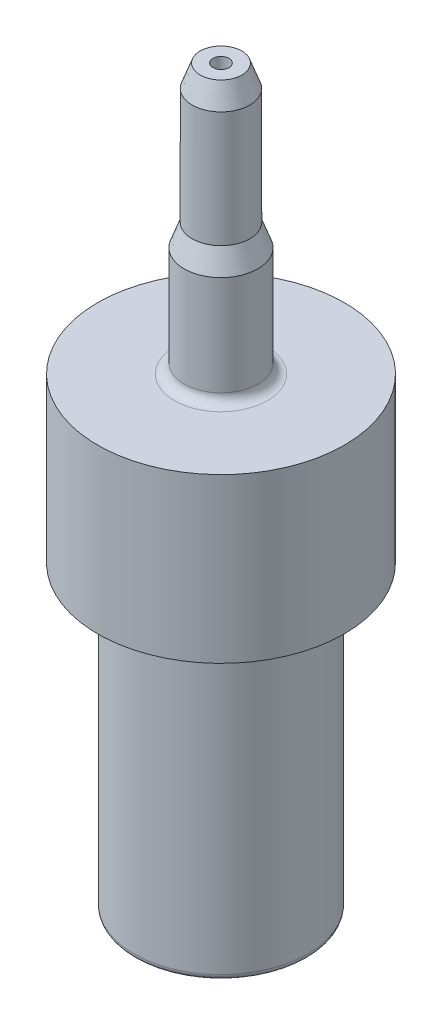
ISO-10303-21;
HEADER;
FILE_DESCRIPTION(('STEP AP214'),'2;1');
FILE_NAME('part.step','',(''),(''),'','','');
FILE_SCHEMA(('AUTOMOTIVE_DESIGN { 1 0 10303 214 1 1 1 1 }'));
ENDSEC;
DATA;
#1=APPLICATION_CONTEXT('core data for automotive mechanical design processes');
#2=APPLICATION_PROTOCOL_DEFINITION('international standard','automotive_design',2000,#1);
#3=PRODUCT_CONTEXT('',#1,'mechanical');
#4=PRODUCT('Part','Part','',(#3));
#5=PRODUCT_RELATED_PRODUCT_CATEGORY('part','',(#4));
#6=PRODUCT_DEFINITION_FORMATION('','',#4);
#7=PRODUCT_DEFINITION_CONTEXT('part definition',#1,'design');
#8=PRODUCT_DEFINITION('design','',#6,#7);
#9=PRODUCT_DEFINITION_SHAPE('','',#8);
#10=(LENGTH_UNIT() NAMED_UNIT(*) SI_UNIT(.MILLI.,.METRE.));
#11=(NAMED_UNIT(*) PLANE_ANGLE_UNIT() SI_UNIT($,.RADIAN.));
#12=(NAMED_UNIT(*) SI_UNIT($,.STERADIAN.) SOLID_ANGLE_UNIT());
#13=UNCERTAINTY_MEASURE_WITH_UNIT(LENGTH_MEASURE(1.E-05),#10,'distance_accuracy_value','');
#14=(GEOMETRIC_REPRESENTATION_CONTEXT(3) GLOBAL_UNCERTAINTY_ASSIGNED_CONTEXT((#13)) GLOBAL_UNIT_ASSIGNED_CONTEXT((#10,
#11,#12)) REPRESENTATION_CONTEXT('',''));
#15=CARTESIAN_POINT('',(0.,0.,0.));
#16=DIRECTION('',(0.,0.,1.));
#17=DIRECTION('',(1.,0.,0.));
#18=AXIS2_PLACEMENT_3D('',#15,#16,#17);
#19=CARTESIAN_POINT('',(2.58474408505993E-12,-740.300128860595,0.));
#20=DIRECTION('',(0.,-1.,0.));
#21=DIRECTION('',(1.,0.,0.));
#22=AXIS2_PLACEMENT_3D('',#19,#20,#21);
#23=CYLINDRICAL_SURFACE('',#22,2.70510000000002);
#24=CARTESIAN_POINT('',(0.,0.179999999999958,0.));
#25=DIRECTION('',(0.,-1.,0.));
#26=DIRECTION('',(1.,0.,0.));
#27=AXIS2_PLACEMENT_3D('',#24,#25,#26);
#28=CIRCLE('',#27,2.70510000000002);
#29=CARTESIAN_POINT('',(2.70510000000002,0.179999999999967,0.));
#30=VERTEX_POINT('',#29);
#31=EDGE_CURVE('E10',#30,#30,#28,.F.);
#32=ORIENTED_EDGE('',*,*,#31,.T.);
#33=EDGE_LOOP('',(#32));
#34=FACE_BOUND('',#33,.T.);
#35=CARTESIAN_POINT('',(0.,9.1,0.));
#36=DIRECTION('',(0.,-1.,0.));
#37=DIRECTION('',(1.,0.,0.));
#38=AXIS2_PLACEMENT_3D('',#35,#36,#37);
#39=CIRCLE('',#38,2.70510000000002);
#40=CARTESIAN_POINT('',(2.70509999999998,9.1,0.));
#41=VERTEX_POINT('',#40);
#42=EDGE_CURVE('E57',#41,#41,#39,.T.);
#43=ORIENTED_EDGE('',*,*,#42,.T.);
#44=EDGE_LOOP('',(#43));
#45=FACE_BOUND('',#44,.T.);
#46=ADVANCED_FACE('F34',(#34,#45),#23,.T.);
#47=CARTESIAN_POINT('',(0.250000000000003,0.,0.));
#48=DIRECTION('',(0.,-1.,0.));
#49=DIRECTION('',(1.,0.,0.));
#50=AXIS2_PLACEMENT_3D('',#47,#48,#49);
#51=PLANE('',#50);
#52=CARTESIAN_POINT('',(0.,0.,0.));
#53=DIRECTION('',(0.,-1.,0.));
#54=DIRECTION('',(1.,0.,0.));
#55=AXIS2_PLACEMENT_3D('',#52,#53,#54);
#56=CIRCLE('',#55,2.52510000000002);
#57=CARTESIAN_POINT('',(2.52510000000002,0.,0.));
#58=VERTEX_POINT('',#57);
#59=EDGE_CURVE('E41',#58,#58,#56,.T.);
#60=ORIENTED_EDGE('',*,*,#59,.T.);
#61=EDGE_LOOP('',(#60));
#62=FACE_BOUND('',#61,.T.);
#63=CARTESIAN_POINT('',(0.,0.,0.));
#64=DIRECTION('',(0.,-1.,0.));
#65=DIRECTION('',(1.,0.,0.));
#66=AXIS2_PLACEMENT_3D('',#63,#64,#65);
#67=CIRCLE('',#66,0.250000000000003);
#68=CARTESIAN_POINT('',(0.250000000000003,0.,0.));
#69=VERTEX_POINT('',#68);
#70=EDGE_CURVE('E66',#69,#69,#67,.T.);
#71=ORIENTED_EDGE('',*,*,#70,.F.);
#72=EDGE_LOOP('',(#71));
#73=FACE_BOUND('',#72,.T.);
#74=ADVANCED_FACE('F103',(#62,#73),#51,.T.);
#75=CARTESIAN_POINT('',(2.58474408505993E-12,-740.300128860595,0.));
#76=DIRECTION('',(0.,-1.,0.));
#77=DIRECTION('',(1.,0.,0.));
#78=AXIS2_PLACEMENT_3D('',#75,#76,#77);
#79=CYLINDRICAL_SURFACE('',#78,0.250000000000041);
#80=ORIENTED_EDGE('',*,*,#70,.T.);
#81=EDGE_LOOP('',(#80));
#82=FACE_BOUND('',#81,.T.);
#83=CARTESIAN_POINT('',(0.,22.9,0.));
#84=DIRECTION('',(0.,-1.,0.));
#85=DIRECTION('',(1.,0.,0.));
#86=AXIS2_PLACEMENT_3D('',#83,#84,#85);
#87=CIRCLE('',#86,0.25000000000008);
#88=CARTESIAN_POINT('',(0.25,22.9,0.));
#89=VERTEX_POINT('',#88);
#90=EDGE_CURVE('E69',#89,#89,#87,.T.);
#91=ORIENTED_EDGE('',*,*,#90,.F.);
#92=EDGE_LOOP('',(#91));
#93=FACE_BOUND('',#92,.T.);
#94=ADVANCED_FACE('F108',(#82,#93),#79,.F.);
#95=CARTESIAN_POINT('',(0.9,22.9,0.));
#96=DIRECTION('',(0.,1.,0.));
#97=DIRECTION('',(-1.,0.,0.));
#98=AXIS2_PLACEMENT_3D('',#95,#96,#97);
#99=PLANE('',#98);
#100=CARTESIAN_POINT('',(0.,22.9,0.));
#101=DIRECTION('',(0.,1.,0.));
#102=DIRECTION('',(-1.,0.,0.));
#103=AXIS2_PLACEMENT_3D('',#100,#101,#102);
#104=CIRCLE('',#103,0.650000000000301);
#105=CARTESIAN_POINT('',(-0.65000000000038,22.9,0.));
#106=VERTEX_POINT('',#105);
#107=EDGE_CURVE('E60',#106,#106,#104,.T.);
#108=ORIENTED_EDGE('',*,*,#107,.T.);
#109=EDGE_LOOP('',(#108));
#110=FACE_BOUND('',#109,.T.);
#111=ORIENTED_EDGE('',*,*,#90,.T.);
#112=EDGE_LOOP('',(#111));
#113=FACE_BOUND('',#112,.T.);
#114=ADVANCED_FACE('F145',(#110,#113),#99,.T.);
#115=CARTESIAN_POINT('',(2.58474408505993E-12,-740.300128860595,0.));
#116=DIRECTION('',(0.,-1.,0.));
#117=DIRECTION('',(1.,0.,0.));
#118=AXIS2_PLACEMENT_3D('',#115,#116,#117);
#119=CYLINDRICAL_SURFACE('',#118,0.900000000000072);
#120=CARTESIAN_POINT('',(0.,22.213130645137,0.));
#121=DIRECTION('',(0.,1.,0.));
#122=DIRECTION('',(-1.,0.,0.));
#123=AXIS2_PLACEMENT_3D('',#120,#121,#122);
#124=CIRCLE('',#123,0.900000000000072);
#125=CARTESIAN_POINT('',(-0.90000000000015,22.213130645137,0.));
#126=VERTEX_POINT('',#125);
#127=EDGE_CURVE('E63',#126,#126,#124,.F.);
#128=ORIENTED_EDGE('',*,*,#127,.T.);
#129=EDGE_LOOP('',(#128));
#130=FACE_BOUND('',#129,.T.);
#131=CARTESIAN_POINT('',(0.,18.6,0.));
#132=DIRECTION('',(0.,-1.,0.));
#133=DIRECTION('',(1.,0.,0.));
#134=AXIS2_PLACEMENT_3D('',#131,#132,#133);
#135=CIRCLE('',#134,0.900000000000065);
#136=CARTESIAN_POINT('',(0.9,18.6,0.));
#137=VERTEX_POINT('',#136);
#138=EDGE_CURVE('E72',#137,#137,#135,.T.);
#139=ORIENTED_EDGE('',*,*,#138,.F.);
#140=EDGE_LOOP('',(#139));
#141=FACE_BOUND('',#140,.T.);
#142=ADVANCED_FACE('F139',(#130,#141),#119,.T.);
#143=CARTESIAN_POINT('',(0.,17.9131306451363,0.));
#144=DIRECTION('',(0.,-1.,0.));
#145=DIRECTION('',(1.,0.,0.));
#146=AXIS2_PLACEMENT_3D('',#143,#144,#145);
#147=CONICAL_SURFACE('',#146,1.15000000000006,0.349065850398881);
#148=ORIENTED_EDGE('',*,*,#138,.T.);
#149=EDGE_LOOP('',(#148));
#150=FACE_BOUND('',#149,.T.);
#151=CARTESIAN_POINT('',(0.,17.9131306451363,0.));
#152=DIRECTION('',(0.,-1.,0.));
#153=DIRECTION('',(1.,0.,0.));
#154=AXIS2_PLACEMENT_3D('',#151,#152,#153);
#155=CIRCLE('',#154,1.15000000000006);
#156=CARTESIAN_POINT('',(1.15,17.9131306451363,0.));
#157=VERTEX_POINT('',#156);
#158=EDGE_CURVE('E75',#157,#157,#155,.T.);
#159=ORIENTED_EDGE('',*,*,#158,.F.);
#160=EDGE_LOOP('',(#159));
#161=FACE_BOUND('',#160,.T.);
#162=ADVANCED_FACE('F134',(#150,#161),#147,.T.);
#163=CARTESIAN_POINT('',(2.58474408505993E-12,-740.300128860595,0.));
#164=DIRECTION('',(0.,-1.,0.));
#165=DIRECTION('',(1.,0.,0.));
#166=AXIS2_PLACEMENT_3D('',#163,#164,#165);
#167=CYLINDRICAL_SURFACE('',#166,1.15000000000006);
#168=CARTESIAN_POINT('',(0.,14.8,0.));
#169=DIRECTION('',(0.,1.,0.));
#170=DIRECTION('',(-1.,0.,0.));
#171=AXIS2_PLACEMENT_3D('',#168,#169,#170);
#172=CIRCLE('',#171,1.15000000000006);
#173=CARTESIAN_POINT('',(-1.15000000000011,14.8,0.));
#174=VERTEX_POINT('',#173);
#175=EDGE_CURVE('E45',#174,#174,#172,.T.);
#176=ORIENTED_EDGE('',*,*,#175,.T.);
#177=EDGE_LOOP('',(#176));
#178=FACE_BOUND('',#177,.T.);
#179=ORIENTED_EDGE('',*,*,#158,.T.);
#180=EDGE_LOOP('',(#179));
#181=FACE_BOUND('',#180,.T.);
#182=ADVANCED_FACE('F99',(#178,#181),#167,.T.);
#183=CARTESIAN_POINT('',(3.85,14.5,0.));
#184=DIRECTION('',(0.,1.,0.));
#185=DIRECTION('',(-1.,0.,0.));
#186=AXIS2_PLACEMENT_3D('',#183,#184,#185);
#187=PLANE('',#186);
#188=CARTESIAN_POINT('',(0.,14.5,0.));
#189=DIRECTION('',(0.,1.,0.));
#190=DIRECTION('',(-1.,0.,0.));
#191=AXIS2_PLACEMENT_3D('',#188,#189,#190);
#192=CIRCLE('',#191,1.45000000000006);
#193=CARTESIAN_POINT('',(-1.45000000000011,14.5,0.));
#194=VERTEX_POINT('',#193);
#195=EDGE_CURVE('E49',#194,#194,#192,.F.);
#196=ORIENTED_EDGE('',*,*,#195,.T.);
#197=EDGE_LOOP('',(#196));
#198=FACE_BOUND('',#197,.T.);
#199=CARTESIAN_POINT('',(0.,14.5,0.));
#200=DIRECTION('',(0.,-1.,0.));
#201=DIRECTION('',(1.,0.,0.));
#202=AXIS2_PLACEMENT_3D('',#199,#200,#201);
#203=CIRCLE('',#202,3.85000000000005);
#204=CARTESIAN_POINT('',(3.85,14.5,0.));
#205=VERTEX_POINT('',#204);
#206=EDGE_CURVE('E78',#205,#205,#203,.T.);
#207=ORIENTED_EDGE('',*,*,#206,.F.);
#208=EDGE_LOOP('',(#207));
#209=FACE_BOUND('',#208,.T.);
#210=ADVANCED_FACE('F89',(#198,#209),#187,.T.);
#211=CARTESIAN_POINT('',(2.58474408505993E-12,-740.300128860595,0.));
#212=DIRECTION('',(0.,-1.,0.));
#213=DIRECTION('',(1.,0.,0.));
#214=AXIS2_PLACEMENT_3D('',#211,#212,#213);
#215=CYLINDRICAL_SURFACE('',#214,3.85000000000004);
#216=ORIENTED_EDGE('',*,*,#206,.T.);
#217=EDGE_LOOP('',(#216));
#218=FACE_BOUND('',#217,.T.);
#219=CARTESIAN_POINT('',(0.,9.39999999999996,0.));
#220=DIRECTION('',(0.,-1.,0.));
#221=DIRECTION('',(1.,0.,0.));
#222=AXIS2_PLACEMENT_3D('',#219,#220,#221);
#223=CIRCLE('',#222,3.85000000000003);
#224=CARTESIAN_POINT('',(3.85,9.39999999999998,0.));
#225=VERTEX_POINT('',#224);
#226=EDGE_CURVE('E81',#225,#225,#223,.T.);
#227=ORIENTED_EDGE('',*,*,#226,.F.);
#228=EDGE_LOOP('',(#227));
#229=FACE_BOUND('',#228,.T.);
#230=ADVANCED_FACE('F87',(#218,#229),#215,.T.);
#231=CARTESIAN_POINT('',(2.7051,9.4,0.));
#232=DIRECTION('',(0.,-1.,0.));
#233=DIRECTION('',(1.,0.,0.));
#234=AXIS2_PLACEMENT_3D('',#231,#232,#233);
#235=PLANE('',#234);
#236=CARTESIAN_POINT('',(0.,9.39999999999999,0.));
#237=DIRECTION('',(0.,-1.,0.));
#238=DIRECTION('',(1.,0.,0.));
#239=AXIS2_PLACEMENT_3D('',#236,#237,#238);
#240=CIRCLE('',#239,3.00510000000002);
#241=CARTESIAN_POINT('',(3.00509999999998,9.4,0.));
#242=VERTEX_POINT('',#241);
#243=EDGE_CURVE('E54',#242,#242,#240,.F.);
#244=ORIENTED_EDGE('',*,*,#243,.T.);
#245=EDGE_LOOP('',(#244));
#246=FACE_BOUND('',#245,.T.);
#247=ORIENTED_EDGE('',*,*,#226,.T.);
#248=EDGE_LOOP('',(#247));
#249=FACE_BOUND('',#248,.T.);
#250=ADVANCED_FACE('F85',(#246,#249),#235,.T.);
#251=CARTESIAN_POINT('',(0.,22.213130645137,0.));
#252=DIRECTION('',(0.,-1.,0.));
#253=DIRECTION('',(1.,0.,0.));
#254=AXIS2_PLACEMENT_3D('',#251,#252,#253);
#255=CONICAL_SURFACE('',#254,0.900000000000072,0.349065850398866);
#256=ORIENTED_EDGE('',*,*,#107,.F.);
#257=EDGE_LOOP('',(#256));
#258=FACE_BOUND('',#257,.T.);
#259=ORIENTED_EDGE('',*,*,#127,.F.);
#260=EDGE_LOOP('',(#259));
#261=FACE_BOUND('',#260,.T.);
#262=ADVANCED_FACE('F96',(#258,#261),#255,.T.);
#263=CARTESIAN_POINT('',(0.,9.1,0.));
#264=DIRECTION('',(0.,-1.,0.));
#265=DIRECTION('',(1.,0.,0.));
#266=AXIS2_PLACEMENT_3D('',#263,#264,#265);
#267=TOROIDAL_SURFACE('',#266,3.00510000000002,0.3);
#268=ORIENTED_EDGE('',*,*,#243,.F.);
#269=EDGE_LOOP('',(#268));
#270=FACE_BOUND('',#269,.T.);
#271=ORIENTED_EDGE('',*,*,#42,.F.);
#272=EDGE_LOOP('',(#271));
#273=FACE_BOUND('',#272,.T.);
#274=ADVANCED_FACE('F115',(#270,#273),#267,.F.);
#275=CARTESIAN_POINT('',(0.,14.8,0.));
#276=DIRECTION('',(0.,1.,0.));
#277=DIRECTION('',(-1.,0.,0.));
#278=AXIS2_PLACEMENT_3D('',#275,#276,#277);
#279=TOROIDAL_SURFACE('',#278,1.45000000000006,0.3);
#280=ORIENTED_EDGE('',*,*,#175,.F.);
#281=EDGE_LOOP('',(#280));
#282=FACE_BOUND('',#281,.T.);
#283=ORIENTED_EDGE('',*,*,#195,.F.);
#284=EDGE_LOOP('',(#283));
#285=FACE_BOUND('',#284,.T.);
#286=ADVANCED_FACE('F118',(#282,#285),#279,.F.);
#287=CARTESIAN_POINT('',(0.,0.179999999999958,0.));
#288=DIRECTION('',(0.,-1.,0.));
#289=DIRECTION('',(1.,0.,0.));
#290=AXIS2_PLACEMENT_3D('',#287,#288,#289);
#291=TOROIDAL_SURFACE('',#290,2.52510000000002,0.18);
#292=ORIENTED_EDGE('',*,*,#31,.F.);
#293=EDGE_LOOP('',(#292));
#294=FACE_BOUND('',#293,.T.);
#295=ORIENTED_EDGE('',*,*,#59,.F.);
#296=EDGE_LOOP('',(#295));
#297=FACE_BOUND('',#296,.T.);
#298=ADVANCED_FACE('F36',(#294,#297),#291,.T.);
#299=CLOSED_SHELL('',(#46,#74,#94,#114,#142,#162,#182,#210,#230,#250,#262,#274,#286,#298));
#300=MANIFOLD_SOLID_BREP('B2',#299);
#301=ADVANCED_BREP_SHAPE_REPRESENTATION('',(#18,#300),#14);
#302=SHAPE_DEFINITION_REPRESENTATION(#9,#301);
ENDSEC;
END-ISO-10303-21;
